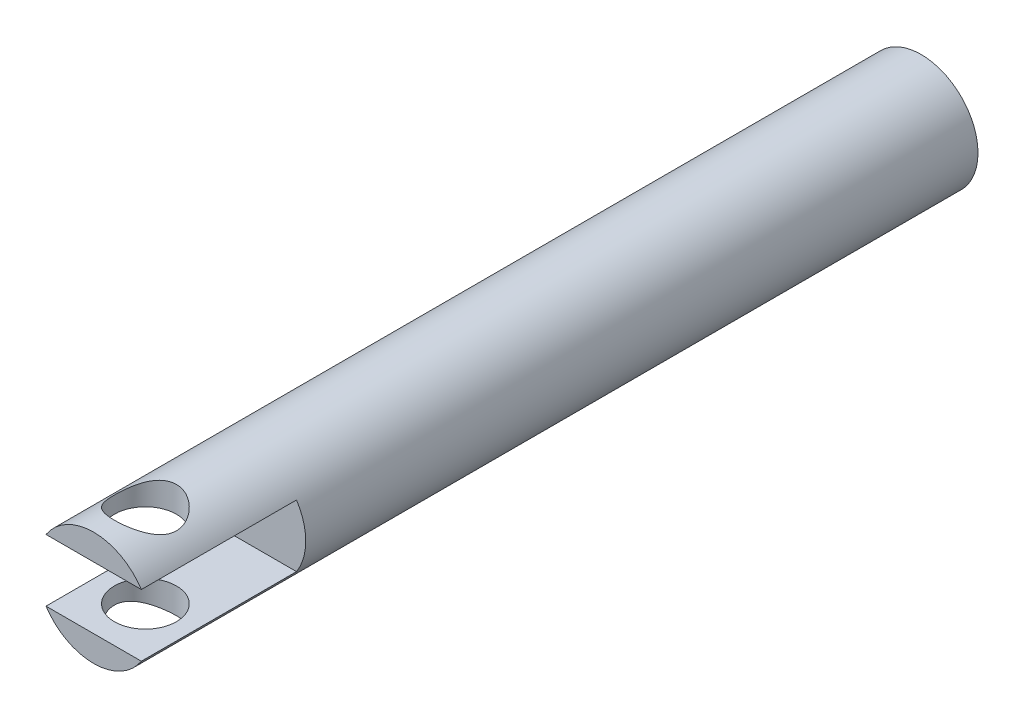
ISO-10303-21;
HEADER;
FILE_DESCRIPTION(('STEP AP214'),'2;1');
FILE_NAME('part.step','',(''),(''),'','','');
FILE_SCHEMA(('AUTOMOTIVE_DESIGN { 1 0 10303 214 1 1 1 1 }'));
ENDSEC;
DATA;
#1=APPLICATION_CONTEXT('core data for automotive mechanical design processes');
#2=APPLICATION_PROTOCOL_DEFINITION('international standard','automotive_design',2000,#1);
#3=PRODUCT_CONTEXT('',#1,'mechanical');
#4=PRODUCT('Part','Part','',(#3));
#5=PRODUCT_RELATED_PRODUCT_CATEGORY('part','',(#4));
#6=PRODUCT_DEFINITION_FORMATION('','',#4);
#7=PRODUCT_DEFINITION_CONTEXT('part definition',#1,'design');
#8=PRODUCT_DEFINITION('design','',#6,#7);
#9=PRODUCT_DEFINITION_SHAPE('','',#8);
#10=(LENGTH_UNIT() NAMED_UNIT(*) SI_UNIT(.MILLI.,.METRE.));
#11=(NAMED_UNIT(*) PLANE_ANGLE_UNIT() SI_UNIT($,.RADIAN.));
#12=(NAMED_UNIT(*) SI_UNIT($,.STERADIAN.) SOLID_ANGLE_UNIT());
#13=UNCERTAINTY_MEASURE_WITH_UNIT(LENGTH_MEASURE(1.E-05),#10,'distance_accuracy_value','');
#14=(GEOMETRIC_REPRESENTATION_CONTEXT(3) GLOBAL_UNCERTAINTY_ASSIGNED_CONTEXT((#13)) GLOBAL_UNIT_ASSIGNED_CONTEXT((#10,
#11,#12)) REPRESENTATION_CONTEXT('',''));
#15=CARTESIAN_POINT('',(0.,0.,0.));
#16=DIRECTION('',(0.,0.,1.));
#17=DIRECTION('',(1.,0.,0.));
#18=AXIS2_PLACEMENT_3D('',#15,#16,#17);
#19=CARTESIAN_POINT('',(0.,0.,160.));
#20=DIRECTION('',(0.,0.,1.));
#21=DIRECTION('',(1.,0.,0.));
#22=AXIS2_PLACEMENT_3D('',#19,#20,#21);
#23=PLANE('',#22);
#24=CARTESIAN_POINT('',(0.,0.,160.));
#25=DIRECTION('',(0.,0.,1.));
#26=DIRECTION('',(1.,0.,0.));
#27=AXIS2_PLACEMENT_3D('',#24,#25,#26);
#28=CIRCLE('',#27,11.);
#29=CARTESIAN_POINT('',(-9.21954445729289,-6.,160.));
#30=VERTEX_POINT('',#29);
#31=CARTESIAN_POINT('',(9.21954445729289,-6.,160.));
#32=VERTEX_POINT('',#31);
#33=EDGE_CURVE('E84',#30,#32,#28,.T.);
#34=ORIENTED_EDGE('',*,*,#33,.T.);
#35=DIRECTION('',(-1.,0.,0.));
#36=VECTOR('',#35,1.);
#37=CARTESIAN_POINT('',(0.,-6.,160.));
#38=LINE('',#37,#36);
#39=EDGE_CURVE('E71',#32,#30,#38,.T.);
#40=ORIENTED_EDGE('',*,*,#39,.T.);
#41=EDGE_LOOP('',(#34,#40));
#42=FACE_BOUND('',#41,.T.);
#43=ADVANCED_FACE('F31',(#42),#23,.T.);
#44=CARTESIAN_POINT('',(0.,0.,160.));
#45=DIRECTION('',(0.,0.,-1.));
#46=DIRECTION('',(-1.,0.,0.));
#47=AXIS2_PLACEMENT_3D('',#44,#45,#46);
#48=CYLINDRICAL_SURFACE('',#47,11.);
#49=CARTESIAN_POINT('',(0.,11.,144.));
#50=CARTESIAN_POINT('',(0.156010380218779,11.0000011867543,143.999998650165));
#51=CARTESIAN_POINT('',(0.31200455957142,10.9966744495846,144.006090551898));
#52=CARTESIAN_POINT('',(0.622821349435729,10.9834552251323,144.030377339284));
#53=CARTESIAN_POINT('',(0.77764358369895,10.9735607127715,144.048575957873));
#54=CARTESIAN_POINT('',(1.08503168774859,10.9474438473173,144.096870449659));
#55=CARTESIAN_POINT('',(1.23759514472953,10.9312151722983,144.126978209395));
#56=CARTESIAN_POINT('',(1.53927854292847,10.8928305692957,144.198734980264));
#57=CARTESIAN_POINT('',(1.68839705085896,10.8706722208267,144.240388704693));
#58=CARTESIAN_POINT('',(1.9814897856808,10.8210757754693,144.334554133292));
#59=CARTESIAN_POINT('',(2.12548439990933,10.7936622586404,144.38701536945));
#60=CARTESIAN_POINT('',(2.4082374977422,10.7341189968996,144.50238762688));
#61=CARTESIAN_POINT('',(2.5469939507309,10.7019874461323,144.56530265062));
#62=CARTESIAN_POINT('',(2.95417573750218,10.5995727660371,144.768864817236));
#63=CARTESIAN_POINT('',(3.21380265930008,10.5232185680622,144.924423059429));
#64=CARTESIAN_POINT('',(3.72135467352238,10.3550938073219,145.282516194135));
#65=CARTESIAN_POINT('',(3.96728059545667,10.2626276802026,145.487527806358));
#66=CARTESIAN_POINT('',(4.42327099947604,10.0744970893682,145.933506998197));
#67=CARTESIAN_POINT('',(4.63330253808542,9.97882978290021,146.174507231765));
#68=CARTESIAN_POINT('',(4.92743173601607,9.83534061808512,146.572006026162));
#69=CARTESIAN_POINT('',(5.02558641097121,9.78541050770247,146.717556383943));
#70=CARTESIAN_POINT('',(5.20923885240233,9.68888926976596,147.017593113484));
#71=CARTESIAN_POINT('',(5.2947339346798,9.64229885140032,147.172081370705));
#72=CARTESIAN_POINT('',(5.45221590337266,9.55413491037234,147.489092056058));
#73=CARTESIAN_POINT('',(5.52420813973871,9.51255940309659,147.651611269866));
#74=CARTESIAN_POINT('',(5.6538677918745,9.43607164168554,147.98368730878));
#75=CARTESIAN_POINT('',(5.71154438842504,9.40115512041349,148.153239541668));
#76=CARTESIAN_POINT('',(5.80864821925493,9.34144809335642,148.487402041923));
#77=CARTESIAN_POINT('',(5.8489924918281,9.31616018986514,148.651656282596));
#78=CARTESIAN_POINT('',(5.91578625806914,9.2738904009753,148.98402965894));
#79=CARTESIAN_POINT('',(5.94223646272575,9.25690809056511,149.152148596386));
#80=CARTESIAN_POINT('',(5.98074958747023,9.23207250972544,149.49049968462));
#81=CARTESIAN_POINT('',(5.99282955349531,9.22420842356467,149.660729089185));
#82=CARTESIAN_POINT('',(6.00242316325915,9.21796911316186,150.001762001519));
#83=CARTESIAN_POINT('',(5.99993873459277,9.21959263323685,150.172565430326));
#84=CARTESIAN_POINT('',(5.9819196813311,9.23129020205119,150.487519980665));
#85=CARTESIAN_POINT('',(5.96839049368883,9.24006532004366,150.631840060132));
#86=CARTESIAN_POINT('',(5.93102194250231,9.26409593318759,150.918638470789));
#87=CARTESIAN_POINT('',(5.90717927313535,9.27935350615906,151.061116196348));
#88=CARTESIAN_POINT('',(5.84948068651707,9.31583260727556,151.34324371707));
#89=CARTESIAN_POINT('',(5.81562500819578,9.3370539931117,151.482893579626));
#90=CARTESIAN_POINT('',(5.7382812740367,9.38478484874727,151.758595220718));
#91=CARTESIAN_POINT('',(5.69478938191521,9.41129642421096,151.894645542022));
#92=CARTESIAN_POINT('',(5.54840735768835,9.49885898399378,152.302067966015));
#93=CARTESIAN_POINT('',(5.43083546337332,9.5671218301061,152.566777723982));
#94=CARTESIAN_POINT('',(5.1607823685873,9.71545143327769,153.073934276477));
#95=CARTESIAN_POINT('',(5.0082859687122,9.79552332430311,153.316371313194));
#96=CARTESIAN_POINT('',(4.64530299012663,9.97336784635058,153.811753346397));
#97=CARTESIAN_POINT('',(4.42949409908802,10.0719619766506,154.060517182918));
#98=CARTESIAN_POINT('',(3.95912475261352,10.265960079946,154.520337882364));
#99=CARTESIAN_POINT('',(3.70453879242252,10.361361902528,154.73136972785));
#100=CARTESIAN_POINT('',(3.28839795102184,10.4980829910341,155.021714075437));
#101=CARTESIAN_POINT('',(3.13890064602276,10.5438573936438,155.116524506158));
#102=CARTESIAN_POINT('',(2.83107937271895,10.6306399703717,155.293054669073));
#103=CARTESIAN_POINT('',(2.67275921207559,10.6716501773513,155.374779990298));
#104=CARTESIAN_POINT('',(2.34836093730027,10.7476951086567,155.524226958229));
#105=CARTESIAN_POINT('',(2.18228670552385,10.7827327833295,155.591955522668));
#106=CARTESIAN_POINT('',(1.84354705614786,10.8457822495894,155.712586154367));
#107=CARTESIAN_POINT('',(1.67088256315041,10.8737950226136,155.765490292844));
#108=CARTESIAN_POINT('',(1.33662060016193,10.9196716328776,155.851531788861));
#109=CARTESIAN_POINT('',(1.17547152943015,10.9382333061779,155.886042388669));
#110=CARTESIAN_POINT('',(0.850244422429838,10.9683062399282,155.941741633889));
#111=CARTESIAN_POINT('',(0.686166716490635,10.9798182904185,155.96293177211));
#112=CARTESIAN_POINT('',(0.356552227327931,10.9954572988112,155.991679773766));
#113=CARTESIAN_POINT('',(0.191016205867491,10.9995879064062,155.999244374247));
#114=CARTESIAN_POINT('',(-0.140126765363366,11.000353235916,156.000647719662));
#115=CARTESIAN_POINT('',(-0.305733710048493,10.9969884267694,155.994487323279));
#116=CARTESIAN_POINT('',(-0.619685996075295,10.9835449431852,155.969786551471));
#117=CARTESIAN_POINT('',(-0.76816060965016,10.9741426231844,155.952492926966));
#118=CARTESIAN_POINT('',(-1.06298195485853,10.9495184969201,155.906972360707));
#119=CARTESIAN_POINT('',(-1.20932800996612,10.9342948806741,155.878742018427));
#120=CARTESIAN_POINT('',(-1.49882837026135,10.8983845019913,155.811676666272));
#121=CARTESIAN_POINT('',(-1.64198367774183,10.8776994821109,155.772845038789));
#122=CARTESIAN_POINT('',(-1.92434061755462,10.8313154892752,155.684961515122));
#123=CARTESIAN_POINT('',(-2.06354068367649,10.8056145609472,155.635905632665));
#124=CARTESIAN_POINT('',(-2.34029670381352,10.7491117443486,155.526810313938));
#125=CARTESIAN_POINT('',(-2.47774316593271,10.7182070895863,155.466546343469));
#126=CARTESIAN_POINT('',(-2.74699015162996,10.6523839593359,155.336331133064));
#127=CARTESIAN_POINT('',(-2.87878875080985,10.6174641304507,155.266376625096));
#128=CARTESIAN_POINT('',(-3.26476472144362,10.5077455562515,155.04278336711));
#129=CARTESIAN_POINT('',(-3.50967812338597,10.4279546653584,154.875352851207));
#130=CARTESIAN_POINT('',(-3.99637377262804,10.2519856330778,154.487353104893));
#131=CARTESIAN_POINT('',(-4.23480145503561,10.1549713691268,154.262951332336));
#132=CARTESIAN_POINT('',(-4.56279609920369,10.009759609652,153.89969092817));
#133=CARTESIAN_POINT('',(-4.66726239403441,9.96136643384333,153.774043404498));
#134=CARTESIAN_POINT('',(-4.86585945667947,9.86587714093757,153.514275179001));
#135=CARTESIAN_POINT('',(-4.95998842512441,9.81878125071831,153.380153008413));
#136=CARTESIAN_POINT('',(-5.14398543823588,9.72373061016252,153.093629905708));
#137=CARTESIAN_POINT('',(-5.23300033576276,9.67597774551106,152.940612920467));
#138=CARTESIAN_POINT('',(-5.3976022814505,9.58513042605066,152.626279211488));
#139=CARTESIAN_POINT('',(-5.47319576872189,9.54203374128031,152.464966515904));
#140=CARTESIAN_POINT('',(-5.61011988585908,9.46217932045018,152.135045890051));
#141=CARTESIAN_POINT('',(-5.67146350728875,9.42541581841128,151.966444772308));
#142=CARTESIAN_POINT('',(-5.77911642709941,9.35979696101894,151.623014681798));
#143=CARTESIAN_POINT('',(-5.82542850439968,9.33094014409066,151.448186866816));
#144=CARTESIAN_POINT('',(-5.89849985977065,9.28490051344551,151.111073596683));
#145=CARTESIAN_POINT('',(-5.92672327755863,9.2668549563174,150.94922312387));
#146=CARTESIAN_POINT('',(-5.96983033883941,9.23914439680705,150.623040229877));
#147=CARTESIAN_POINT('',(-5.98471496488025,9.2294787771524,150.458707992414));
#148=CARTESIAN_POINT('',(-6.00087462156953,9.21898029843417,150.129205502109));
#149=CARTESIAN_POINT('',(-6.00215898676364,9.21814138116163,149.9640359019));
#150=CARTESIAN_POINT('',(-5.99111876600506,9.22532057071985,149.634356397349));
#151=CARTESIAN_POINT('',(-5.97879523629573,9.23333799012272,149.4698464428));
#152=CARTESIAN_POINT('',(-5.94328523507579,9.25622688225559,149.164697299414));
#153=CARTESIAN_POINT('',(-5.92175407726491,9.27004967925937,149.023782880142));
#154=CARTESIAN_POINT('',(-5.86889658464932,9.30360254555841,148.744500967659));
#155=CARTESIAN_POINT('',(-5.83756709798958,9.32333451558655,148.606134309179));
#156=CARTESIAN_POINT('',(-5.72938151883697,9.39049973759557,148.196126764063));
#157=CARTESIAN_POINT('',(-5.63830782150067,9.44591636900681,147.929406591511));
#158=CARTESIAN_POINT('',(-5.41482407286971,9.5758690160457,147.398485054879));
#159=CARTESIAN_POINT('',(-5.28019375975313,9.65138046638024,147.135474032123));
#160=CARTESIAN_POINT('',(-4.97556130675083,9.81190517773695,146.633997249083));
#161=CARTESIAN_POINT('',(-4.80554027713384,9.89692350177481,146.395544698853));
#162=CARTESIAN_POINT('',(-4.40438664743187,10.0825204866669,145.911652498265));
#163=CARTESIAN_POINT('',(-4.16787953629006,10.1834844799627,145.670758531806));
#164=CARTESIAN_POINT('',(-3.78428175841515,10.3294761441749,145.340840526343));
#165=CARTESIAN_POINT('',(-3.65147825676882,10.3772711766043,145.236025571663));
#166=CARTESIAN_POINT('',(-3.3768173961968,10.4698643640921,145.037563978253));
#167=CARTESIAN_POINT('',(-3.23496401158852,10.514663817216,144.943912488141));
#168=CARTESIAN_POINT('',(-2.93814833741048,10.6015079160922,144.765668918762));
#169=CARTESIAN_POINT('',(-2.7829100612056,10.6434160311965,144.681469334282));
#170=CARTESIAN_POINT('',(-2.46452362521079,10.7216123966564,144.52666151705));
#171=CARTESIAN_POINT('',(-2.30137939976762,10.7579034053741,144.456046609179));
#172=CARTESIAN_POINT('',(-1.96859017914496,10.8237406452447,144.329348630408));
#173=CARTESIAN_POINT('',(-1.79895853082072,10.853299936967,144.273237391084));
#174=CARTESIAN_POINT('',(-1.45437089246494,10.9048214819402,144.176184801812));
#175=CARTESIAN_POINT('',(-1.27941778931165,10.9267877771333,144.13523538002));
#176=CARTESIAN_POINT('',(-0.921489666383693,10.9628450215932,144.068323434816));
#177=CARTESIAN_POINT('',(-0.738422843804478,10.9767355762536,144.042741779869));
#178=CARTESIAN_POINT('',(-0.370229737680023,10.99531233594,144.008580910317));
#179=CARTESIAN_POINT('',(-0.185103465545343,10.9999985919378,144.000001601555));
#180=CARTESIAN_POINT('',(0.,11.,144.));
#181=B_SPLINE_CURVE_WITH_KNOTS('',3,(#49,#50,#51,#52,#53,#54,#55,#56,#57,#58,#59,#60,#61,#62,
#63,#64,#65,#66,#67,#68,#69,#70,#71,#72,#73,#74,#75,#76,#77,#78,#79,#80,#81,#82,#83,#84,#85,#86,
#87,#88,#89,#90,#91,#92,#93,#94,#95,#96,#97,#98,#99,#100,#101,#102,#103,#104,#105,#106,#107,
#108,#109,#110,#111,#112,#113,#114,#115,#116,#117,#118,#119,#120,#121,#122,#123,#124,#125,#126,
#127,#128,#129,#130,#131,#132,#133,#134,#135,#136,#137,#138,#139,#140,#141,#142,#143,#144,#145,
#146,#147,#148,#149,#150,#151,#152,#153,#154,#155,#156,#157,#158,#159,#160,#161,#162,#163,#164,
#165,#166,#167,#168,#169,#170,#171,#172,#173,#174,#175,#176,#177,#178,#179,#180),.UNSPECIFIED.,
.T.,.F.,(4,2,2,2,2,2,2,2,2,2,2,2,2,2,2,2,2,2,2,2,2,2,2,2,2,2,2,2,2,2,2,2,2,2,2,2,2,2,2,2,2,2,2,
2,2,2,2,2,2,2,2,2,2,2,2,2,2,2,2,2,2,2,2,2,2,4),(0.,0.467849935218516,0.935844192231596,
1.4043067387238,1.87296080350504,2.33947407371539,2.80616637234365,3.73863650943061,
4.73457273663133,5.73141817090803,6.27839563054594,6.8254888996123,7.37236494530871,
7.9188893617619,8.43116917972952,8.94342278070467,9.45506814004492,9.96664578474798,
10.4017831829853,10.8370601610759,11.2723267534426,11.7077669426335,12.5967862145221,
13.4861931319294,14.5132563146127,15.5409979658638,16.0889213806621,16.6366101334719,
17.1840275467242,17.7313684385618,18.2282185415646,18.7250129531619,19.2215616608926,
19.7180793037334,20.16687638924,20.6158131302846,21.0646068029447,21.5135757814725,
21.9727612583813,22.4321019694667,23.3502759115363,24.3701982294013,24.8810255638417,
25.3919416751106,25.9412903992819,26.4903748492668,27.0389567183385,27.5874371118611,
28.0825450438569,28.5776165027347,29.0723481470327,29.5670413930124,29.996201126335,
30.4254990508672,31.2835804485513,32.1950771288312,33.1070615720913,34.159031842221,
34.6859580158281,35.2126543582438,35.7564385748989,36.2999549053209,36.8424075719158,
37.3845710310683,37.9396695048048,38.4947649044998),.UNSPECIFIED.);
#182=CARTESIAN_POINT('',(0.,11.,144.));
#183=VERTEX_POINT('',#182);
#184=EDGE_CURVE('E179',#183,#183,#181,.T.);
#185=ORIENTED_EDGE('',*,*,#184,.T.);
#186=EDGE_LOOP('',(#185));
#187=FACE_BOUND('',#186,.T.);
#188=CARTESIAN_POINT('',(0.,-11.,144.));
#189=CARTESIAN_POINT('',(-0.156010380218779,-11.0000011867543,143.999998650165));
#190=CARTESIAN_POINT('',(-0.31200455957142,-10.9966744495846,144.006090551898));
#191=CARTESIAN_POINT('',(-0.622821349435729,-10.9834552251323,144.030377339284));
#192=CARTESIAN_POINT('',(-0.77764358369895,-10.9735607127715,144.048575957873));
#193=CARTESIAN_POINT('',(-1.08503168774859,-10.9474438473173,144.096870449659));
#194=CARTESIAN_POINT('',(-1.23759514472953,-10.9312151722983,144.126978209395));
#195=CARTESIAN_POINT('',(-1.53927854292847,-10.8928305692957,144.198734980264));
#196=CARTESIAN_POINT('',(-1.68839705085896,-10.8706722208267,144.240388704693));
#197=CARTESIAN_POINT('',(-1.9814897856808,-10.8210757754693,144.334554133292));
#198=CARTESIAN_POINT('',(-2.12548439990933,-10.7936622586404,144.38701536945));
#199=CARTESIAN_POINT('',(-2.4082374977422,-10.7341189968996,144.50238762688));
#200=CARTESIAN_POINT('',(-2.5469939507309,-10.7019874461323,144.56530265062));
#201=CARTESIAN_POINT('',(-2.95417573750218,-10.5995727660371,144.768864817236));
#202=CARTESIAN_POINT('',(-3.21380265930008,-10.5232185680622,144.924423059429));
#203=CARTESIAN_POINT('',(-3.72135467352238,-10.3550938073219,145.282516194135));
#204=CARTESIAN_POINT('',(-3.96728059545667,-10.2626276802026,145.487527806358));
#205=CARTESIAN_POINT('',(-4.42327099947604,-10.0744970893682,145.933506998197));
#206=CARTESIAN_POINT('',(-4.63330253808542,-9.97882978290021,146.174507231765));
#207=CARTESIAN_POINT('',(-4.92743173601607,-9.83534061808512,146.572006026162));
#208=CARTESIAN_POINT('',(-5.02558641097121,-9.78541050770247,146.717556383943));
#209=CARTESIAN_POINT('',(-5.20923885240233,-9.68888926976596,147.017593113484));
#210=CARTESIAN_POINT('',(-5.2947339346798,-9.64229885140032,147.172081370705));
#211=CARTESIAN_POINT('',(-5.45221590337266,-9.55413491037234,147.489092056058));
#212=CARTESIAN_POINT('',(-5.52420813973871,-9.51255940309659,147.651611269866));
#213=CARTESIAN_POINT('',(-5.6538677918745,-9.43607164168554,147.98368730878));
#214=CARTESIAN_POINT('',(-5.71154438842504,-9.40115512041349,148.153239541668));
#215=CARTESIAN_POINT('',(-5.80864821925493,-9.34144809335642,148.487402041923));
#216=CARTESIAN_POINT('',(-5.8489924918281,-9.31616018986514,148.651656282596));
#217=CARTESIAN_POINT('',(-5.91578625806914,-9.2738904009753,148.98402965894));
#218=CARTESIAN_POINT('',(-5.94223646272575,-9.25690809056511,149.152148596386));
#219=CARTESIAN_POINT('',(-5.98074958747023,-9.23207250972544,149.49049968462));
#220=CARTESIAN_POINT('',(-5.99282955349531,-9.22420842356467,149.660729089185));
#221=CARTESIAN_POINT('',(-6.00242316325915,-9.21796911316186,150.001762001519));
#222=CARTESIAN_POINT('',(-5.99993873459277,-9.21959263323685,150.172565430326));
#223=CARTESIAN_POINT('',(-5.9819196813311,-9.23129020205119,150.487519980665));
#224=CARTESIAN_POINT('',(-5.96839049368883,-9.24006532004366,150.631840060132));
#225=CARTESIAN_POINT('',(-5.93102194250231,-9.26409593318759,150.918638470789));
#226=CARTESIAN_POINT('',(-5.90717927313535,-9.27935350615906,151.061116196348));
#227=CARTESIAN_POINT('',(-5.84948068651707,-9.31583260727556,151.34324371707));
#228=CARTESIAN_POINT('',(-5.81562500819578,-9.3370539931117,151.482893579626));
#229=CARTESIAN_POINT('',(-5.7382812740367,-9.38478484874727,151.758595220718));
#230=CARTESIAN_POINT('',(-5.69478938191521,-9.41129642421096,151.894645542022));
#231=CARTESIAN_POINT('',(-5.54840735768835,-9.49885898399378,152.302067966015));
#232=CARTESIAN_POINT('',(-5.43083546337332,-9.5671218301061,152.566777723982));
#233=CARTESIAN_POINT('',(-5.1607823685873,-9.71545143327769,153.073934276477));
#234=CARTESIAN_POINT('',(-5.0082859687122,-9.79552332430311,153.316371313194));
#235=CARTESIAN_POINT('',(-4.64530299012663,-9.97336784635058,153.811753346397));
#236=CARTESIAN_POINT('',(-4.42949409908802,-10.0719619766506,154.060517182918));
#237=CARTESIAN_POINT('',(-3.95912475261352,-10.265960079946,154.520337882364));
#238=CARTESIAN_POINT('',(-3.70453879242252,-10.361361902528,154.73136972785));
#239=CARTESIAN_POINT('',(-3.28839795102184,-10.4980829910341,155.021714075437));
#240=CARTESIAN_POINT('',(-3.13890064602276,-10.5438573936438,155.116524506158));
#241=CARTESIAN_POINT('',(-2.83107937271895,-10.6306399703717,155.293054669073));
#242=CARTESIAN_POINT('',(-2.67275921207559,-10.6716501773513,155.374779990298));
#243=CARTESIAN_POINT('',(-2.34836093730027,-10.7476951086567,155.524226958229));
#244=CARTESIAN_POINT('',(-2.18228670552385,-10.7827327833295,155.591955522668));
#245=CARTESIAN_POINT('',(-1.84354705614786,-10.8457822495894,155.712586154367));
#246=CARTESIAN_POINT('',(-1.67088256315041,-10.8737950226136,155.765490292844));
#247=CARTESIAN_POINT('',(-1.33662060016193,-10.9196716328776,155.851531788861));
#248=CARTESIAN_POINT('',(-1.17547152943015,-10.9382333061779,155.886042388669));
#249=CARTESIAN_POINT('',(-0.850244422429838,-10.9683062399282,155.941741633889));
#250=CARTESIAN_POINT('',(-0.686166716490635,-10.9798182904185,155.96293177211));
#251=CARTESIAN_POINT('',(-0.356552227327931,-10.9954572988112,155.991679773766));
#252=CARTESIAN_POINT('',(-0.191016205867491,-10.9995879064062,155.999244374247));
#253=CARTESIAN_POINT('',(0.140126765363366,-11.000353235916,156.000647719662));
#254=CARTESIAN_POINT('',(0.305733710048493,-10.9969884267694,155.994487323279));
#255=CARTESIAN_POINT('',(0.619685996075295,-10.9835449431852,155.969786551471));
#256=CARTESIAN_POINT('',(0.76816060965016,-10.9741426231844,155.952492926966));
#257=CARTESIAN_POINT('',(1.06298195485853,-10.9495184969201,155.906972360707));
#258=CARTESIAN_POINT('',(1.20932800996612,-10.9342948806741,155.878742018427));
#259=CARTESIAN_POINT('',(1.49882837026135,-10.8983845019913,155.811676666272));
#260=CARTESIAN_POINT('',(1.64198367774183,-10.8776994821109,155.772845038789));
#261=CARTESIAN_POINT('',(1.92434061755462,-10.8313154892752,155.684961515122));
#262=CARTESIAN_POINT('',(2.06354068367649,-10.8056145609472,155.635905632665));
#263=CARTESIAN_POINT('',(2.34029670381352,-10.7491117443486,155.526810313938));
#264=CARTESIAN_POINT('',(2.47774316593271,-10.7182070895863,155.466546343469));
#265=CARTESIAN_POINT('',(2.74699015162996,-10.6523839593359,155.336331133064));
#266=CARTESIAN_POINT('',(2.87878875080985,-10.6174641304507,155.266376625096));
#267=CARTESIAN_POINT('',(3.26476472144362,-10.5077455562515,155.04278336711));
#268=CARTESIAN_POINT('',(3.50967812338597,-10.4279546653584,154.875352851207));
#269=CARTESIAN_POINT('',(3.99637377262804,-10.2519856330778,154.487353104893));
#270=CARTESIAN_POINT('',(4.23480145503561,-10.1549713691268,154.262951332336));
#271=CARTESIAN_POINT('',(4.56279609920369,-10.009759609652,153.89969092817));
#272=CARTESIAN_POINT('',(4.66726239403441,-9.96136643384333,153.774043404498));
#273=CARTESIAN_POINT('',(4.86585945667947,-9.86587714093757,153.514275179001));
#274=CARTESIAN_POINT('',(4.95998842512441,-9.81878125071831,153.380153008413));
#275=CARTESIAN_POINT('',(5.14398543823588,-9.72373061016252,153.093629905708));
#276=CARTESIAN_POINT('',(5.23300033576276,-9.67597774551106,152.940612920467));
#277=CARTESIAN_POINT('',(5.3976022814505,-9.58513042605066,152.626279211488));
#278=CARTESIAN_POINT('',(5.47319576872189,-9.54203374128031,152.464966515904));
#279=CARTESIAN_POINT('',(5.61011988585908,-9.46217932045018,152.135045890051));
#280=CARTESIAN_POINT('',(5.67146350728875,-9.42541581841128,151.966444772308));
#281=CARTESIAN_POINT('',(5.77911642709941,-9.35979696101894,151.623014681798));
#282=CARTESIAN_POINT('',(5.82542850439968,-9.33094014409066,151.448186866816));
#283=CARTESIAN_POINT('',(5.89849985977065,-9.28490051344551,151.111073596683));
#284=CARTESIAN_POINT('',(5.92672327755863,-9.2668549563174,150.94922312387));
#285=CARTESIAN_POINT('',(5.96983033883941,-9.23914439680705,150.623040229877));
#286=CARTESIAN_POINT('',(5.98471496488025,-9.2294787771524,150.458707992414));
#287=CARTESIAN_POINT('',(6.00087462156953,-9.21898029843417,150.129205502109));
#288=CARTESIAN_POINT('',(6.00215898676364,-9.21814138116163,149.9640359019));
#289=CARTESIAN_POINT('',(5.99111876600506,-9.22532057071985,149.634356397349));
#290=CARTESIAN_POINT('',(5.97879523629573,-9.23333799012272,149.4698464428));
#291=CARTESIAN_POINT('',(5.94328523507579,-9.25622688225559,149.164697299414));
#292=CARTESIAN_POINT('',(5.92175407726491,-9.27004967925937,149.023782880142));
#293=CARTESIAN_POINT('',(5.86889658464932,-9.30360254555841,148.744500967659));
#294=CARTESIAN_POINT('',(5.83756709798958,-9.32333451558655,148.606134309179));
#295=CARTESIAN_POINT('',(5.72938151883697,-9.39049973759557,148.196126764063));
#296=CARTESIAN_POINT('',(5.63830782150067,-9.44591636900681,147.929406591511));
#297=CARTESIAN_POINT('',(5.41482407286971,-9.5758690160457,147.398485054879));
#298=CARTESIAN_POINT('',(5.28019375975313,-9.65138046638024,147.135474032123));
#299=CARTESIAN_POINT('',(4.97556130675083,-9.81190517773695,146.633997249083));
#300=CARTESIAN_POINT('',(4.80554027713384,-9.89692350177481,146.395544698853));
#301=CARTESIAN_POINT('',(4.40438664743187,-10.0825204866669,145.911652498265));
#302=CARTESIAN_POINT('',(4.16787953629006,-10.1834844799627,145.670758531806));
#303=CARTESIAN_POINT('',(3.78428175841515,-10.3294761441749,145.340840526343));
#304=CARTESIAN_POINT('',(3.65147825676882,-10.3772711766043,145.236025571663));
#305=CARTESIAN_POINT('',(3.3768173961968,-10.4698643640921,145.037563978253));
#306=CARTESIAN_POINT('',(3.23496401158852,-10.514663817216,144.943912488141));
#307=CARTESIAN_POINT('',(2.93814833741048,-10.6015079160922,144.765668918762));
#308=CARTESIAN_POINT('',(2.7829100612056,-10.6434160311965,144.681469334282));
#309=CARTESIAN_POINT('',(2.46452362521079,-10.7216123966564,144.52666151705));
#310=CARTESIAN_POINT('',(2.30137939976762,-10.7579034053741,144.456046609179));
#311=CARTESIAN_POINT('',(1.96859017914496,-10.8237406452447,144.329348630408));
#312=CARTESIAN_POINT('',(1.79895853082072,-10.853299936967,144.273237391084));
#313=CARTESIAN_POINT('',(1.45437089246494,-10.9048214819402,144.176184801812));
#314=CARTESIAN_POINT('',(1.27941778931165,-10.9267877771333,144.13523538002));
#315=CARTESIAN_POINT('',(0.921489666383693,-10.9628450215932,144.068323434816));
#316=CARTESIAN_POINT('',(0.738422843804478,-10.9767355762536,144.042741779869));
#317=CARTESIAN_POINT('',(0.370229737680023,-10.99531233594,144.008580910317));
#318=CARTESIAN_POINT('',(0.185103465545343,-10.9999985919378,144.000001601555));
#319=CARTESIAN_POINT('',(0.,-11.,144.));
#320=B_SPLINE_CURVE_WITH_KNOTS('',3,(#188,#189,#190,#191,#192,#193,#194,#195,#196,#197,#198,
#199,#200,#201,#202,#203,#204,#205,#206,#207,#208,#209,#210,#211,#212,#213,#214,#215,#216,#217,
#218,#219,#220,#221,#222,#223,#224,#225,#226,#227,#228,#229,#230,#231,#232,#233,#234,#235,#236,
#237,#238,#239,#240,#241,#242,#243,#244,#245,#246,#247,#248,#249,#250,#251,#252,#253,#254,#255,
#256,#257,#258,#259,#260,#261,#262,#263,#264,#265,#266,#267,#268,#269,#270,#271,#272,#273,#274,
#275,#276,#277,#278,#279,#280,#281,#282,#283,#284,#285,#286,#287,#288,#289,#290,#291,#292,#293,
#294,#295,#296,#297,#298,#299,#300,#301,#302,#303,#304,#305,#306,#307,#308,#309,#310,#311,#312,
#313,#314,#315,#316,#317,#318,#319),.UNSPECIFIED.,.T.,.F.,(4,2,2,2,2,2,2,2,2,2,2,2,2,2,2,2,2,2,
2,2,2,2,2,2,2,2,2,2,2,2,2,2,2,2,2,2,2,2,2,2,2,2,2,2,2,2,2,2,2,2,2,2,2,2,2,2,2,2,2,2,2,2,2,2,2,
4),(0.,0.467849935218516,0.935844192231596,1.4043067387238,1.87296080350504,2.33947407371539,
2.80616637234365,3.73863650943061,4.73457273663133,5.73141817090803,6.27839563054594,
6.8254888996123,7.37236494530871,7.9188893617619,8.43116917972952,8.94342278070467,
9.45506814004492,9.96664578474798,10.4017831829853,10.8370601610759,11.2723267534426,
11.7077669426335,12.5967862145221,13.4861931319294,14.5132563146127,15.5409979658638,
16.0889213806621,16.6366101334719,17.1840275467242,17.7313684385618,18.2282185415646,
18.7250129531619,19.2215616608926,19.7180793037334,20.16687638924,20.6158131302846,
21.0646068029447,21.5135757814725,21.9727612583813,22.4321019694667,23.3502759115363,
24.3701982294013,24.8810255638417,25.3919416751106,25.9412903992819,26.4903748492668,
27.0389567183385,27.5874371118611,28.0825450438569,28.5776165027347,29.0723481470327,
29.5670413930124,29.996201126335,30.4254990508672,31.2835804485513,32.1950771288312,
33.1070615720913,34.159031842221,34.6859580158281,35.2126543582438,35.7564385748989,
36.2999549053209,36.8424075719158,37.3845710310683,37.9396695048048,38.4947649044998),.UNSPECIFIED.);
#321=CARTESIAN_POINT('',(0.,-11.,144.));
#322=VERTEX_POINT('',#321);
#323=EDGE_CURVE('E174',#322,#322,#320,.T.);
#324=ORIENTED_EDGE('',*,*,#323,.T.);
#325=EDGE_LOOP('',(#324));
#326=FACE_BOUND('',#325,.T.);
#327=CARTESIAN_POINT('',(9.21954445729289,6.,160.));
#328=VERTEX_POINT('',#327);
#329=CARTESIAN_POINT('',(-9.21954445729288,6.,160.));
#330=VERTEX_POINT('',#329);
#331=EDGE_CURVE('E80',#328,#330,#28,.T.);
#332=ORIENTED_EDGE('',*,*,#331,.F.);
#333=DIRECTION('',(0.,0.,-1.));
#334=VECTOR('',#333,1.);
#335=CARTESIAN_POINT('',(9.21954445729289,6.,160.));
#336=LINE('',#335,#334);
#337=CARTESIAN_POINT('',(9.21954445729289,6.,130.));
#338=VERTEX_POINT('',#337);
#339=EDGE_CURVE('E92',#328,#338,#336,.T.);
#340=ORIENTED_EDGE('',*,*,#339,.T.);
#341=CARTESIAN_POINT('',(0.,0.,130.));
#342=DIRECTION('',(0.,0.,-1.));
#343=DIRECTION('',(-1.,0.,0.));
#344=AXIS2_PLACEMENT_3D('',#341,#342,#343);
#345=CIRCLE('',#344,11.);
#346=CARTESIAN_POINT('',(9.21954445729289,-6.,130.));
#347=VERTEX_POINT('',#346);
#348=EDGE_CURVE('E11',#338,#347,#345,.T.);
#349=ORIENTED_EDGE('',*,*,#348,.T.);
#350=DIRECTION('',(0.,0.,-1.));
#351=VECTOR('',#350,1.);
#352=CARTESIAN_POINT('',(9.21954445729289,-6.,160.));
#353=LINE('',#352,#351);
#354=EDGE_CURVE('E74',#32,#347,#353,.T.);
#355=ORIENTED_EDGE('',*,*,#354,.F.);
#356=ORIENTED_EDGE('',*,*,#33,.F.);
#357=DIRECTION('',(0.,0.,-1.));
#358=VECTOR('',#357,1.);
#359=CARTESIAN_POINT('',(-9.21954445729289,-6.,160.));
#360=LINE('',#359,#358);
#361=CARTESIAN_POINT('',(-9.21954445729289,-6.,130.));
#362=VERTEX_POINT('',#361);
#363=EDGE_CURVE('E48',#362,#30,#360,.F.);
#364=ORIENTED_EDGE('',*,*,#363,.F.);
#365=CARTESIAN_POINT('',(-9.21954445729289,6.,130.));
#366=VERTEX_POINT('',#365);
#367=EDGE_CURVE('E41',#362,#366,#345,.T.);
#368=ORIENTED_EDGE('',*,*,#367,.T.);
#369=DIRECTION('',(0.,0.,-1.));
#370=VECTOR('',#369,1.);
#371=CARTESIAN_POINT('',(-9.21954445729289,6.,160.));
#372=LINE('',#371,#370);
#373=EDGE_CURVE('E86',#366,#330,#372,.F.);
#374=ORIENTED_EDGE('',*,*,#373,.T.);
#375=EDGE_LOOP('',(#332,#340,#349,#355,#356,#364,#368,#374));
#376=FACE_BOUND('',#375,.T.);
#377=CARTESIAN_POINT('',(0.,0.,0.));
#378=DIRECTION('',(0.,0.,1.));
#379=DIRECTION('',(1.,0.,0.));
#380=AXIS2_PLACEMENT_3D('',#377,#378,#379);
#381=CIRCLE('',#380,11.);
#382=CARTESIAN_POINT('',(11.,0.,0.));
#383=VERTEX_POINT('',#382);
#384=EDGE_CURVE('E88',#383,#383,#381,.T.);
#385=ORIENTED_EDGE('',*,*,#384,.T.);
#386=EDGE_LOOP('',(#385));
#387=FACE_BOUND('',#386,.T.);
#388=ADVANCED_FACE('F33',(#187,#326,#376,#387),#48,.T.);
#389=DIRECTION('',(-1.,0.,0.));
#390=VECTOR('',#389,1.);
#391=CARTESIAN_POINT('',(0.,6.,160.));
#392=LINE('',#391,#390);
#393=EDGE_CURVE('E79',#328,#330,#392,.T.);
#394=ORIENTED_EDGE('',*,*,#393,.F.);
#395=ORIENTED_EDGE('',*,*,#331,.T.);
#396=EDGE_LOOP('',(#394,#395));
#397=FACE_BOUND('',#396,.T.);
#398=ADVANCED_FACE('F103',(#397),#23,.T.);
#399=CARTESIAN_POINT('',(0.,0.,0.));
#400=DIRECTION('',(0.,0.,1.));
#401=DIRECTION('',(1.,0.,0.));
#402=AXIS2_PLACEMENT_3D('',#399,#400,#401);
#403=PLANE('',#402);
#404=ORIENTED_EDGE('',*,*,#384,.F.);
#405=EDGE_LOOP('',(#404));
#406=FACE_BOUND('',#405,.T.);
#407=ADVANCED_FACE('F105',(#406),#403,.F.);
#408=CARTESIAN_POINT('',(-11.,-6.,130.));
#409=DIRECTION('',(0.,0.,-1.));
#410=DIRECTION('',(-1.,0.,0.));
#411=AXIS2_PLACEMENT_3D('',#408,#409,#410);
#412=PLANE('',#411);
#413=DIRECTION('',(-1.,0.,0.));
#414=VECTOR('',#413,1.);
#415=CARTESIAN_POINT('',(11.,6.,130.));
#416=LINE('',#415,#414);
#417=EDGE_CURVE('E186',#338,#366,#416,.T.);
#418=ORIENTED_EDGE('',*,*,#417,.T.);
#419=ORIENTED_EDGE('',*,*,#367,.F.);
#420=DIRECTION('',(-1.,0.,0.));
#421=VECTOR('',#420,1.);
#422=CARTESIAN_POINT('',(11.,-6.,130.));
#423=LINE('',#422,#421);
#424=EDGE_CURVE('E184',#347,#362,#423,.T.);
#425=ORIENTED_EDGE('',*,*,#424,.F.);
#426=ORIENTED_EDGE('',*,*,#348,.F.);
#427=EDGE_LOOP('',(#418,#419,#425,#426));
#428=FACE_BOUND('',#427,.T.);
#429=ADVANCED_FACE('F111',(#428),#412,.F.);
#430=CARTESIAN_POINT('',(11.,6.,130.));
#431=DIRECTION('',(0.,1.,0.));
#432=DIRECTION('',(0.,0.,1.));
#433=AXIS2_PLACEMENT_3D('',#430,#431,#432);
#434=PLANE('',#433);
#435=CARTESIAN_POINT('',(0.,6.,150.));
#436=DIRECTION('',(0.,1.,0.));
#437=DIRECTION('',(0.,0.,1.));
#438=AXIS2_PLACEMENT_3D('',#435,#436,#437);
#439=CIRCLE('',#438,6.);
#440=CARTESIAN_POINT('',(0.,6.,156.));
#441=VERTEX_POINT('',#440);
#442=EDGE_CURVE('E204',#441,#441,#439,.T.);
#443=ORIENTED_EDGE('',*,*,#442,.T.);
#444=EDGE_LOOP('',(#443));
#445=FACE_BOUND('',#444,.T.);
#446=ORIENTED_EDGE('',*,*,#393,.T.);
#447=ORIENTED_EDGE('',*,*,#373,.F.);
#448=ORIENTED_EDGE('',*,*,#417,.F.);
#449=ORIENTED_EDGE('',*,*,#339,.F.);
#450=EDGE_LOOP('',(#446,#447,#448,#449));
#451=FACE_BOUND('',#450,.T.);
#452=ADVANCED_FACE('F99',(#445,#451),#434,.F.);
#453=CARTESIAN_POINT('',(11.,-6.,130.));
#454=DIRECTION('',(0.,1.,0.));
#455=DIRECTION('',(0.,0.,1.));
#456=AXIS2_PLACEMENT_3D('',#453,#454,#455);
#457=PLANE('',#456);
#458=CARTESIAN_POINT('',(0.,-6.,150.));
#459=DIRECTION('',(0.,1.,0.));
#460=DIRECTION('',(0.,0.,1.));
#461=AXIS2_PLACEMENT_3D('',#458,#459,#460);
#462=CIRCLE('',#461,6.);
#463=CARTESIAN_POINT('',(0.,-6.,156.));
#464=VERTEX_POINT('',#463);
#465=EDGE_CURVE('E36',#464,#464,#462,.T.);
#466=ORIENTED_EDGE('',*,*,#465,.F.);
#467=EDGE_LOOP('',(#466));
#468=FACE_BOUND('',#467,.T.);
#469=ORIENTED_EDGE('',*,*,#354,.T.);
#470=ORIENTED_EDGE('',*,*,#424,.T.);
#471=ORIENTED_EDGE('',*,*,#363,.T.);
#472=ORIENTED_EDGE('',*,*,#39,.F.);
#473=EDGE_LOOP('',(#469,#470,#471,#472));
#474=FACE_BOUND('',#473,.T.);
#475=ADVANCED_FACE('F73',(#468,#474),#457,.T.);
#476=CARTESIAN_POINT('',(0.,11.,150.));
#477=DIRECTION('',(0.,-1.,0.));
#478=DIRECTION('',(0.,0.,-1.));
#479=AXIS2_PLACEMENT_3D('',#476,#477,#478);
#480=CYLINDRICAL_SURFACE('',#479,6.);
#481=ORIENTED_EDGE('',*,*,#465,.T.);
#482=EDGE_LOOP('',(#481));
#483=FACE_BOUND('',#482,.T.);
#484=ORIENTED_EDGE('',*,*,#323,.F.);
#485=EDGE_LOOP('',(#484));
#486=FACE_BOUND('',#485,.T.);
#487=ADVANCED_FACE('F146',(#483,#486),#480,.F.);
#488=ORIENTED_EDGE('',*,*,#442,.F.);
#489=EDGE_LOOP('',(#488));
#490=FACE_BOUND('',#489,.T.);
#491=ORIENTED_EDGE('',*,*,#184,.F.);
#492=EDGE_LOOP('',(#491));
#493=FACE_BOUND('',#492,.T.);
#494=ADVANCED_FACE('F155',(#490,#493),#480,.F.);
#495=CLOSED_SHELL('',(#43,#388,#398,#407,#429,#452,#475,#487,#494));
#496=MANIFOLD_SOLID_BREP('B2',#495);
#497=ADVANCED_BREP_SHAPE_REPRESENTATION('',(#18,#496),#14);
#498=SHAPE_DEFINITION_REPRESENTATION(#9,#497);
ENDSEC;
END-ISO-10303-21;
